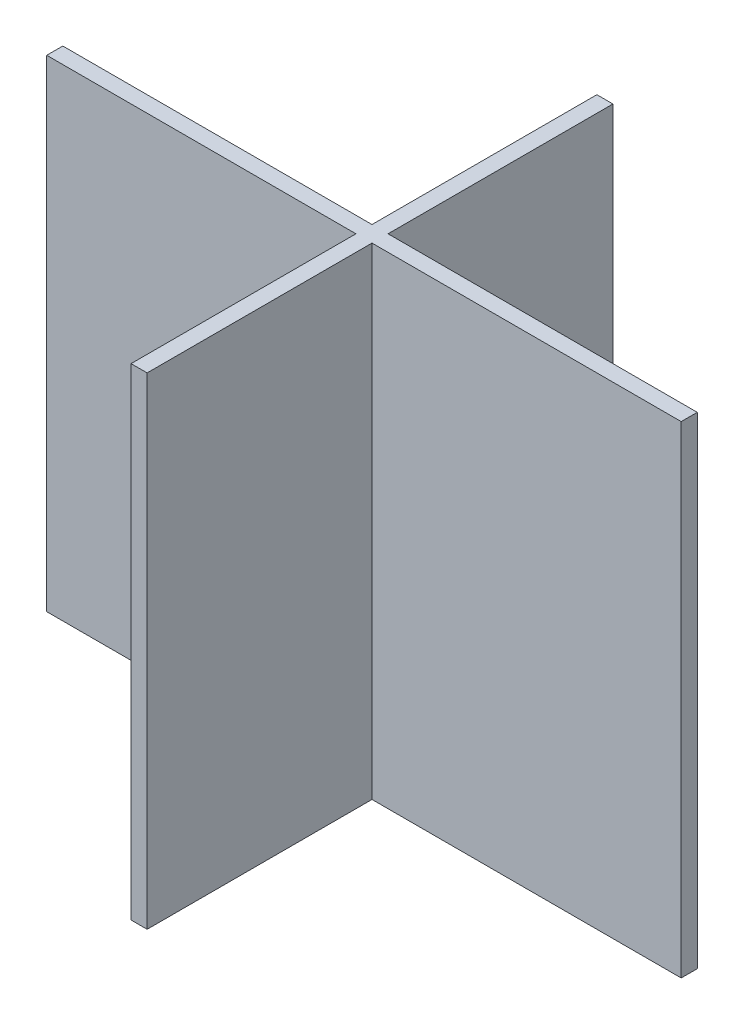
ISO-10303-21;
HEADER;
FILE_DESCRIPTION(('STEP AP214'),'2;1');
FILE_NAME('part.step','',(''),(''),'','','');
FILE_SCHEMA(('AUTOMOTIVE_DESIGN { 1 0 10303 214 1 1 1 1 }'));
ENDSEC;
DATA;
#1=APPLICATION_CONTEXT('core data for automotive mechanical design processes');
#2=APPLICATION_PROTOCOL_DEFINITION('international standard','automotive_design',2000,#1);
#3=PRODUCT_CONTEXT('',#1,'mechanical');
#4=PRODUCT('Part','Part','',(#3));
#5=PRODUCT_RELATED_PRODUCT_CATEGORY('part','',(#4));
#6=PRODUCT_DEFINITION_FORMATION('','',#4);
#7=PRODUCT_DEFINITION_CONTEXT('part definition',#1,'design');
#8=PRODUCT_DEFINITION('design','',#6,#7);
#9=PRODUCT_DEFINITION_SHAPE('','',#8);
#10=(LENGTH_UNIT() NAMED_UNIT(*) SI_UNIT(.MILLI.,.METRE.));
#11=(NAMED_UNIT(*) PLANE_ANGLE_UNIT() SI_UNIT($,.RADIAN.));
#12=(NAMED_UNIT(*) SI_UNIT($,.STERADIAN.) SOLID_ANGLE_UNIT());
#13=UNCERTAINTY_MEASURE_WITH_UNIT(LENGTH_MEASURE(1.E-05),#10,'distance_accuracy_value','');
#14=(GEOMETRIC_REPRESENTATION_CONTEXT(3) GLOBAL_UNCERTAINTY_ASSIGNED_CONTEXT((#13)) GLOBAL_UNIT_ASSIGNED_CONTEXT((#10,
#11,#12)) REPRESENTATION_CONTEXT('',''));
#15=CARTESIAN_POINT('',(0.,0.,0.));
#16=DIRECTION('',(0.,0.,1.));
#17=DIRECTION('',(1.,0.,0.));
#18=AXIS2_PLACEMENT_3D('',#15,#16,#17);
#19=CARTESIAN_POINT('',(0.,60.,1.));
#20=DIRECTION('',(0.,0.,-1.));
#21=DIRECTION('',(-1.,0.,0.));
#22=AXIS2_PLACEMENT_3D('',#19,#20,#21);
#23=PLANE('',#22);
#24=DIRECTION('',(1.,0.,0.));
#25=VECTOR('',#24,1.);
#26=CARTESIAN_POINT('',(0.,0.,1.));
#27=LINE('',#26,#25);
#28=CARTESIAN_POINT('',(-39.5,0.,1.));
#29=VERTEX_POINT('',#28);
#30=CARTESIAN_POINT('',(-1.,0.,1.));
#31=VERTEX_POINT('',#30);
#32=EDGE_CURVE('E169',#29,#31,#27,.T.);
#33=ORIENTED_EDGE('',*,*,#32,.T.);
#34=DIRECTION('',(0.,-1.,0.));
#35=VECTOR('',#34,1.);
#36=CARTESIAN_POINT('',(-1.,60.,1.));
#37=LINE('',#36,#35);
#38=CARTESIAN_POINT('',(-1.,60.,1.));
#39=VERTEX_POINT('',#38);
#40=EDGE_CURVE('E11',#39,#31,#37,.T.);
#41=ORIENTED_EDGE('',*,*,#40,.F.);
#42=DIRECTION('',(1.,0.,0.));
#43=VECTOR('',#42,1.);
#44=CARTESIAN_POINT('',(0.,60.,1.));
#45=LINE('',#44,#43);
#46=CARTESIAN_POINT('',(-39.5,60.,1.));
#47=VERTEX_POINT('',#46);
#48=EDGE_CURVE('E211',#47,#39,#45,.T.);
#49=ORIENTED_EDGE('',*,*,#48,.F.);
#50=DIRECTION('',(0.,-1.,0.));
#51=VECTOR('',#50,1.);
#52=CARTESIAN_POINT('',(-39.5,60.,1.));
#53=LINE('',#52,#51);
#54=EDGE_CURVE('E165',#47,#29,#53,.T.);
#55=ORIENTED_EDGE('',*,*,#54,.T.);
#56=EDGE_LOOP('',(#33,#41,#49,#55));
#57=FACE_BOUND('',#56,.T.);
#58=ADVANCED_FACE('F45',(#57),#23,.F.);
#59=CARTESIAN_POINT('',(-1.,60.,0.));
#60=DIRECTION('',(1.,0.,0.));
#61=DIRECTION('',(0.,0.,-1.));
#62=AXIS2_PLACEMENT_3D('',#59,#60,#61);
#63=PLANE('',#62);
#64=DIRECTION('',(0.,0.,1.));
#65=VECTOR('',#64,1.);
#66=CARTESIAN_POINT('',(-1.,0.,0.));
#67=LINE('',#66,#65);
#68=CARTESIAN_POINT('',(-1.,0.,29.));
#69=VERTEX_POINT('',#68);
#70=EDGE_CURVE('E173',#31,#69,#67,.T.);
#71=ORIENTED_EDGE('',*,*,#70,.T.);
#72=DIRECTION('',(0.,-1.,0.));
#73=VECTOR('',#72,1.);
#74=CARTESIAN_POINT('',(-1.,60.,29.));
#75=LINE('',#74,#73);
#76=CARTESIAN_POINT('',(-1.,60.,29.));
#77=VERTEX_POINT('',#76);
#78=EDGE_CURVE('E54',#77,#69,#75,.T.);
#79=ORIENTED_EDGE('',*,*,#78,.F.);
#80=DIRECTION('',(0.,0.,1.));
#81=VECTOR('',#80,1.);
#82=CARTESIAN_POINT('',(-1.,60.,0.));
#83=LINE('',#82,#81);
#84=EDGE_CURVE('E113',#39,#77,#83,.T.);
#85=ORIENTED_EDGE('',*,*,#84,.F.);
#86=ORIENTED_EDGE('',*,*,#40,.T.);
#87=EDGE_LOOP('',(#71,#79,#85,#86));
#88=FACE_BOUND('',#87,.T.);
#89=ADVANCED_FACE('F293',(#88),#63,.F.);
#90=CARTESIAN_POINT('',(0.,60.,29.));
#91=DIRECTION('',(0.,0.,-1.));
#92=DIRECTION('',(-1.,0.,0.));
#93=AXIS2_PLACEMENT_3D('',#90,#91,#92);
#94=PLANE('',#93);
#95=DIRECTION('',(1.,0.,0.));
#96=VECTOR('',#95,1.);
#97=CARTESIAN_POINT('',(0.,0.,29.));
#98=LINE('',#97,#96);
#99=CARTESIAN_POINT('',(1.,0.,29.));
#100=VERTEX_POINT('',#99);
#101=EDGE_CURVE('E176',#69,#100,#98,.T.);
#102=ORIENTED_EDGE('',*,*,#101,.T.);
#103=DIRECTION('',(0.,-1.,0.));
#104=VECTOR('',#103,1.);
#105=CARTESIAN_POINT('',(1.,60.,29.));
#106=LINE('',#105,#104);
#107=CARTESIAN_POINT('',(1.,60.,29.));
#108=VERTEX_POINT('',#107);
#109=EDGE_CURVE('E233',#108,#100,#106,.T.);
#110=ORIENTED_EDGE('',*,*,#109,.F.);
#111=DIRECTION('',(1.,0.,0.));
#112=VECTOR('',#111,1.);
#113=CARTESIAN_POINT('',(0.,60.,29.));
#114=LINE('',#113,#112);
#115=EDGE_CURVE('E242',#77,#108,#114,.T.);
#116=ORIENTED_EDGE('',*,*,#115,.F.);
#117=ORIENTED_EDGE('',*,*,#78,.T.);
#118=EDGE_LOOP('',(#102,#110,#116,#117));
#119=FACE_BOUND('',#118,.T.);
#120=ADVANCED_FACE('F240',(#119),#94,.F.);
#121=CARTESIAN_POINT('',(1.,60.,0.));
#122=DIRECTION('',(1.,0.,0.));
#123=DIRECTION('',(0.,0.,-1.));
#124=AXIS2_PLACEMENT_3D('',#121,#122,#123);
#125=PLANE('',#124);
#126=DIRECTION('',(0.,0.,1.));
#127=VECTOR('',#126,1.);
#128=CARTESIAN_POINT('',(1.,0.,0.));
#129=LINE('',#128,#127);
#130=CARTESIAN_POINT('',(1.,0.,1.));
#131=VERTEX_POINT('',#130);
#132=EDGE_CURVE('E180',#131,#100,#129,.T.);
#133=ORIENTED_EDGE('',*,*,#132,.F.);
#134=DIRECTION('',(0.,-1.,0.));
#135=VECTOR('',#134,1.);
#136=CARTESIAN_POINT('',(1.,60.,1.));
#137=LINE('',#136,#135);
#138=CARTESIAN_POINT('',(1.,60.,1.));
#139=VERTEX_POINT('',#138);
#140=EDGE_CURVE('E230',#139,#131,#137,.T.);
#141=ORIENTED_EDGE('',*,*,#140,.F.);
#142=DIRECTION('',(0.,0.,1.));
#143=VECTOR('',#142,1.);
#144=CARTESIAN_POINT('',(1.,60.,0.));
#145=LINE('',#144,#143);
#146=EDGE_CURVE('E253',#139,#108,#145,.T.);
#147=ORIENTED_EDGE('',*,*,#146,.T.);
#148=ORIENTED_EDGE('',*,*,#109,.T.);
#149=EDGE_LOOP('',(#133,#141,#147,#148));
#150=FACE_BOUND('',#149,.T.);
#151=ADVANCED_FACE('F249',(#150),#125,.T.);
#152=CARTESIAN_POINT('',(0.,60.,1.));
#153=DIRECTION('',(0.,0.,-1.));
#154=DIRECTION('',(-1.,0.,0.));
#155=AXIS2_PLACEMENT_3D('',#152,#153,#154);
#156=PLANE('',#155);
#157=DIRECTION('',(1.,0.,0.));
#158=VECTOR('',#157,1.);
#159=CARTESIAN_POINT('',(0.,0.,1.));
#160=LINE('',#159,#158);
#161=CARTESIAN_POINT('',(39.5,0.,1.));
#162=VERTEX_POINT('',#161);
#163=EDGE_CURVE('E184',#131,#162,#160,.T.);
#164=ORIENTED_EDGE('',*,*,#163,.T.);
#165=DIRECTION('',(0.,-1.,0.));
#166=VECTOR('',#165,1.);
#167=CARTESIAN_POINT('',(39.5,60.,1.));
#168=LINE('',#167,#166);
#169=CARTESIAN_POINT('',(39.5,60.,1.));
#170=VERTEX_POINT('',#169);
#171=EDGE_CURVE('E227',#170,#162,#168,.T.);
#172=ORIENTED_EDGE('',*,*,#171,.F.);
#173=DIRECTION('',(1.,0.,0.));
#174=VECTOR('',#173,1.);
#175=CARTESIAN_POINT('',(0.,60.,1.));
#176=LINE('',#175,#174);
#177=EDGE_CURVE('E255',#139,#170,#176,.T.);
#178=ORIENTED_EDGE('',*,*,#177,.F.);
#179=ORIENTED_EDGE('',*,*,#140,.T.);
#180=EDGE_LOOP('',(#164,#172,#178,#179));
#181=FACE_BOUND('',#180,.T.);
#182=ADVANCED_FACE('F304',(#181),#156,.F.);
#183=CARTESIAN_POINT('',(39.5,60.,0.));
#184=DIRECTION('',(1.,0.,0.));
#185=DIRECTION('',(0.,0.,-1.));
#186=AXIS2_PLACEMENT_3D('',#183,#184,#185);
#187=PLANE('',#186);
#188=DIRECTION('',(0.,0.,1.));
#189=VECTOR('',#188,1.);
#190=CARTESIAN_POINT('',(39.5,0.,0.));
#191=LINE('',#190,#189);
#192=CARTESIAN_POINT('',(39.5,0.,-1.));
#193=VERTEX_POINT('',#192);
#194=EDGE_CURVE('E188',#193,#162,#191,.T.);
#195=ORIENTED_EDGE('',*,*,#194,.F.);
#196=DIRECTION('',(0.,-1.,0.));
#197=VECTOR('',#196,1.);
#198=CARTESIAN_POINT('',(39.5,60.,-1.));
#199=LINE('',#198,#197);
#200=CARTESIAN_POINT('',(39.5,60.,-1.));
#201=VERTEX_POINT('',#200);
#202=EDGE_CURVE('E224',#201,#193,#199,.T.);
#203=ORIENTED_EDGE('',*,*,#202,.F.);
#204=DIRECTION('',(0.,0.,1.));
#205=VECTOR('',#204,1.);
#206=CARTESIAN_POINT('',(39.5,60.,0.));
#207=LINE('',#206,#205);
#208=EDGE_CURVE('E259',#201,#170,#207,.T.);
#209=ORIENTED_EDGE('',*,*,#208,.T.);
#210=ORIENTED_EDGE('',*,*,#171,.T.);
#211=EDGE_LOOP('',(#195,#203,#209,#210));
#212=FACE_BOUND('',#211,.T.);
#213=ADVANCED_FACE('F307',(#212),#187,.T.);
#214=CARTESIAN_POINT('',(0.,60.,-1.));
#215=DIRECTION('',(0.,0.,-1.));
#216=DIRECTION('',(-1.,0.,0.));
#217=AXIS2_PLACEMENT_3D('',#214,#215,#216);
#218=PLANE('',#217);
#219=DIRECTION('',(1.,0.,0.));
#220=VECTOR('',#219,1.);
#221=CARTESIAN_POINT('',(0.,0.,-1.));
#222=LINE('',#221,#220);
#223=CARTESIAN_POINT('',(1.,0.,-1.));
#224=VERTEX_POINT('',#223);
#225=EDGE_CURVE('E192',#224,#193,#222,.T.);
#226=ORIENTED_EDGE('',*,*,#225,.F.);
#227=DIRECTION('',(0.,-1.,0.));
#228=VECTOR('',#227,1.);
#229=CARTESIAN_POINT('',(1.,60.,-1.));
#230=LINE('',#229,#228);
#231=CARTESIAN_POINT('',(1.,60.,-1.));
#232=VERTEX_POINT('',#231);
#233=EDGE_CURVE('E221',#232,#224,#230,.T.);
#234=ORIENTED_EDGE('',*,*,#233,.F.);
#235=DIRECTION('',(1.,0.,0.));
#236=VECTOR('',#235,1.);
#237=CARTESIAN_POINT('',(0.,60.,-1.));
#238=LINE('',#237,#236);
#239=EDGE_CURVE('E267',#232,#201,#238,.T.);
#240=ORIENTED_EDGE('',*,*,#239,.T.);
#241=ORIENTED_EDGE('',*,*,#202,.T.);
#242=EDGE_LOOP('',(#226,#234,#240,#241));
#243=FACE_BOUND('',#242,.T.);
#244=ADVANCED_FACE('F311',(#243),#218,.T.);
#245=CARTESIAN_POINT('',(1.,60.,0.));
#246=DIRECTION('',(1.,0.,0.));
#247=DIRECTION('',(0.,0.,-1.));
#248=AXIS2_PLACEMENT_3D('',#245,#246,#247);
#249=PLANE('',#248);
#250=DIRECTION('',(0.,0.,1.));
#251=VECTOR('',#250,1.);
#252=CARTESIAN_POINT('',(1.,0.,0.));
#253=LINE('',#252,#251);
#254=CARTESIAN_POINT('',(1.,0.,-29.));
#255=VERTEX_POINT('',#254);
#256=EDGE_CURVE('E196',#255,#224,#253,.T.);
#257=ORIENTED_EDGE('',*,*,#256,.F.);
#258=DIRECTION('',(0.,-1.,0.));
#259=VECTOR('',#258,1.);
#260=CARTESIAN_POINT('',(1.,60.,-29.));
#261=LINE('',#260,#259);
#262=CARTESIAN_POINT('',(1.,60.,-29.));
#263=VERTEX_POINT('',#262);
#264=EDGE_CURVE('E218',#263,#255,#261,.T.);
#265=ORIENTED_EDGE('',*,*,#264,.F.);
#266=DIRECTION('',(0.,0.,1.));
#267=VECTOR('',#266,1.);
#268=CARTESIAN_POINT('',(1.,60.,0.));
#269=LINE('',#268,#267);
#270=EDGE_CURVE('E271',#263,#232,#269,.T.);
#271=ORIENTED_EDGE('',*,*,#270,.T.);
#272=ORIENTED_EDGE('',*,*,#233,.T.);
#273=EDGE_LOOP('',(#257,#265,#271,#272));
#274=FACE_BOUND('',#273,.T.);
#275=ADVANCED_FACE('F315',(#274),#249,.T.);
#276=CARTESIAN_POINT('',(0.,60.,-29.));
#277=DIRECTION('',(0.,0.,-1.));
#278=DIRECTION('',(-1.,0.,0.));
#279=AXIS2_PLACEMENT_3D('',#276,#277,#278);
#280=PLANE('',#279);
#281=DIRECTION('',(1.,0.,0.));
#282=VECTOR('',#281,1.);
#283=CARTESIAN_POINT('',(0.,0.,-29.));
#284=LINE('',#283,#282);
#285=CARTESIAN_POINT('',(-1.,0.,-29.));
#286=VERTEX_POINT('',#285);
#287=EDGE_CURVE('E200',#286,#255,#284,.T.);
#288=ORIENTED_EDGE('',*,*,#287,.F.);
#289=DIRECTION('',(0.,-1.,0.));
#290=VECTOR('',#289,1.);
#291=CARTESIAN_POINT('',(-1.,60.,-29.));
#292=LINE('',#291,#290);
#293=CARTESIAN_POINT('',(-1.,60.,-29.));
#294=VERTEX_POINT('',#293);
#295=EDGE_CURVE('E159',#294,#286,#292,.T.);
#296=ORIENTED_EDGE('',*,*,#295,.F.);
#297=DIRECTION('',(1.,0.,0.));
#298=VECTOR('',#297,1.);
#299=CARTESIAN_POINT('',(0.,60.,-29.));
#300=LINE('',#299,#298);
#301=EDGE_CURVE('E146',#294,#263,#300,.T.);
#302=ORIENTED_EDGE('',*,*,#301,.T.);
#303=ORIENTED_EDGE('',*,*,#264,.T.);
#304=EDGE_LOOP('',(#288,#296,#302,#303));
#305=FACE_BOUND('',#304,.T.);
#306=ADVANCED_FACE('F277',(#305),#280,.T.);
#307=CARTESIAN_POINT('',(-1.,60.,0.));
#308=DIRECTION('',(1.,0.,0.));
#309=DIRECTION('',(0.,0.,-1.));
#310=AXIS2_PLACEMENT_3D('',#307,#308,#309);
#311=PLANE('',#310);
#312=DIRECTION('',(0.,0.,1.));
#313=VECTOR('',#312,1.);
#314=CARTESIAN_POINT('',(-1.,0.,0.));
#315=LINE('',#314,#313);
#316=CARTESIAN_POINT('',(-1.,0.,-1.));
#317=VERTEX_POINT('',#316);
#318=EDGE_CURVE('E154',#286,#317,#315,.T.);
#319=ORIENTED_EDGE('',*,*,#318,.T.);
#320=DIRECTION('',(0.,-1.,0.));
#321=VECTOR('',#320,1.);
#322=CARTESIAN_POINT('',(-1.,60.,-1.));
#323=LINE('',#322,#321);
#324=CARTESIAN_POINT('',(-1.,60.,-1.));
#325=VERTEX_POINT('',#324);
#326=EDGE_CURVE('E151',#325,#317,#323,.T.);
#327=ORIENTED_EDGE('',*,*,#326,.F.);
#328=DIRECTION('',(0.,0.,1.));
#329=VECTOR('',#328,1.);
#330=CARTESIAN_POINT('',(-1.,60.,0.));
#331=LINE('',#330,#329);
#332=EDGE_CURVE('E139',#294,#325,#331,.T.);
#333=ORIENTED_EDGE('',*,*,#332,.F.);
#334=ORIENTED_EDGE('',*,*,#295,.T.);
#335=EDGE_LOOP('',(#319,#327,#333,#334));
#336=FACE_BOUND('',#335,.T.);
#337=ADVANCED_FACE('F152',(#336),#311,.F.);
#338=CARTESIAN_POINT('',(0.,60.,-1.));
#339=DIRECTION('',(0.,0.,-1.));
#340=DIRECTION('',(-1.,0.,0.));
#341=AXIS2_PLACEMENT_3D('',#338,#339,#340);
#342=PLANE('',#341);
#343=DIRECTION('',(1.,0.,0.));
#344=VECTOR('',#343,1.);
#345=CARTESIAN_POINT('',(0.,0.,-1.));
#346=LINE('',#345,#344);
#347=CARTESIAN_POINT('',(-39.5,0.,-1.));
#348=VERTEX_POINT('',#347);
#349=EDGE_CURVE('E206',#348,#317,#346,.T.);
#350=ORIENTED_EDGE('',*,*,#349,.F.);
#351=DIRECTION('',(0.,-1.,0.));
#352=VECTOR('',#351,1.);
#353=CARTESIAN_POINT('',(-39.5,60.,-1.));
#354=LINE('',#353,#352);
#355=CARTESIAN_POINT('',(-39.5,60.,-1.));
#356=VERTEX_POINT('',#355);
#357=EDGE_CURVE('E102',#356,#348,#354,.T.);
#358=ORIENTED_EDGE('',*,*,#357,.F.);
#359=DIRECTION('',(1.,0.,0.));
#360=VECTOR('',#359,1.);
#361=CARTESIAN_POINT('',(0.,60.,-1.));
#362=LINE('',#361,#360);
#363=EDGE_CURVE('E143',#356,#325,#362,.T.);
#364=ORIENTED_EDGE('',*,*,#363,.T.);
#365=ORIENTED_EDGE('',*,*,#326,.T.);
#366=EDGE_LOOP('',(#350,#358,#364,#365));
#367=FACE_BOUND('',#366,.T.);
#368=ADVANCED_FACE('F161',(#367),#342,.T.);
#369=CARTESIAN_POINT('',(-39.5,60.,0.));
#370=DIRECTION('',(1.,0.,0.));
#371=DIRECTION('',(0.,0.,-1.));
#372=AXIS2_PLACEMENT_3D('',#369,#370,#371);
#373=PLANE('',#372);
#374=DIRECTION('',(0.,0.,1.));
#375=VECTOR('',#374,1.);
#376=CARTESIAN_POINT('',(-39.5,0.,0.));
#377=LINE('',#376,#375);
#378=EDGE_CURVE('E105',#348,#29,#377,.T.);
#379=ORIENTED_EDGE('',*,*,#378,.T.);
#380=ORIENTED_EDGE('',*,*,#54,.F.);
#381=DIRECTION('',(0.,0.,1.));
#382=VECTOR('',#381,1.);
#383=CARTESIAN_POINT('',(-39.5,60.,0.));
#384=LINE('',#383,#382);
#385=EDGE_CURVE('E62',#356,#47,#384,.T.);
#386=ORIENTED_EDGE('',*,*,#385,.F.);
#387=ORIENTED_EDGE('',*,*,#357,.T.);
#388=EDGE_LOOP('',(#379,#380,#386,#387));
#389=FACE_BOUND('',#388,.T.);
#390=ADVANCED_FACE('F282',(#389),#373,.F.);
#391=CARTESIAN_POINT('',(0.,60.,0.));
#392=DIRECTION('',(0.,1.,0.));
#393=DIRECTION('',(0.,0.,1.));
#394=AXIS2_PLACEMENT_3D('',#391,#392,#393);
#395=PLANE('',#394);
#396=ORIENTED_EDGE('',*,*,#48,.T.);
#397=ORIENTED_EDGE('',*,*,#84,.T.);
#398=ORIENTED_EDGE('',*,*,#115,.T.);
#399=ORIENTED_EDGE('',*,*,#146,.F.);
#400=ORIENTED_EDGE('',*,*,#177,.T.);
#401=ORIENTED_EDGE('',*,*,#208,.F.);
#402=ORIENTED_EDGE('',*,*,#239,.F.);
#403=ORIENTED_EDGE('',*,*,#270,.F.);
#404=ORIENTED_EDGE('',*,*,#301,.F.);
#405=ORIENTED_EDGE('',*,*,#332,.T.);
#406=ORIENTED_EDGE('',*,*,#363,.F.);
#407=ORIENTED_EDGE('',*,*,#385,.T.);
#408=EDGE_LOOP('',(#396,#397,#398,#399,#400,#401,#402,#403,#404,#405,#406,#407));
#409=FACE_BOUND('',#408,.T.);
#410=ADVANCED_FACE('F141',(#409),#395,.T.);
#411=CARTESIAN_POINT('',(0.,0.,0.));
#412=DIRECTION('',(0.,1.,0.));
#413=DIRECTION('',(0.,0.,1.));
#414=AXIS2_PLACEMENT_3D('',#411,#412,#413);
#415=PLANE('',#414);
#416=ORIENTED_EDGE('',*,*,#32,.F.);
#417=ORIENTED_EDGE('',*,*,#378,.F.);
#418=ORIENTED_EDGE('',*,*,#349,.T.);
#419=ORIENTED_EDGE('',*,*,#318,.F.);
#420=ORIENTED_EDGE('',*,*,#287,.T.);
#421=ORIENTED_EDGE('',*,*,#256,.T.);
#422=ORIENTED_EDGE('',*,*,#225,.T.);
#423=ORIENTED_EDGE('',*,*,#194,.T.);
#424=ORIENTED_EDGE('',*,*,#163,.F.);
#425=ORIENTED_EDGE('',*,*,#132,.T.);
#426=ORIENTED_EDGE('',*,*,#101,.F.);
#427=ORIENTED_EDGE('',*,*,#70,.F.);
#428=EDGE_LOOP('',(#416,#417,#418,#419,#420,#421,#422,#423,#424,#425,#426,#427));
#429=FACE_BOUND('',#428,.T.);
#430=ADVANCED_FACE('F245',(#429),#415,.F.);
#431=CLOSED_SHELL('',(#58,#89,#120,#151,#182,#213,#244,#275,#306,#337,#368,#390,#410,#430));
#432=MANIFOLD_SOLID_BREP('B2',#431);
#433=ADVANCED_BREP_SHAPE_REPRESENTATION('',(#18,#432),#14);
#434=SHAPE_DEFINITION_REPRESENTATION(#9,#433);
ENDSEC;
END-ISO-10303-21;
